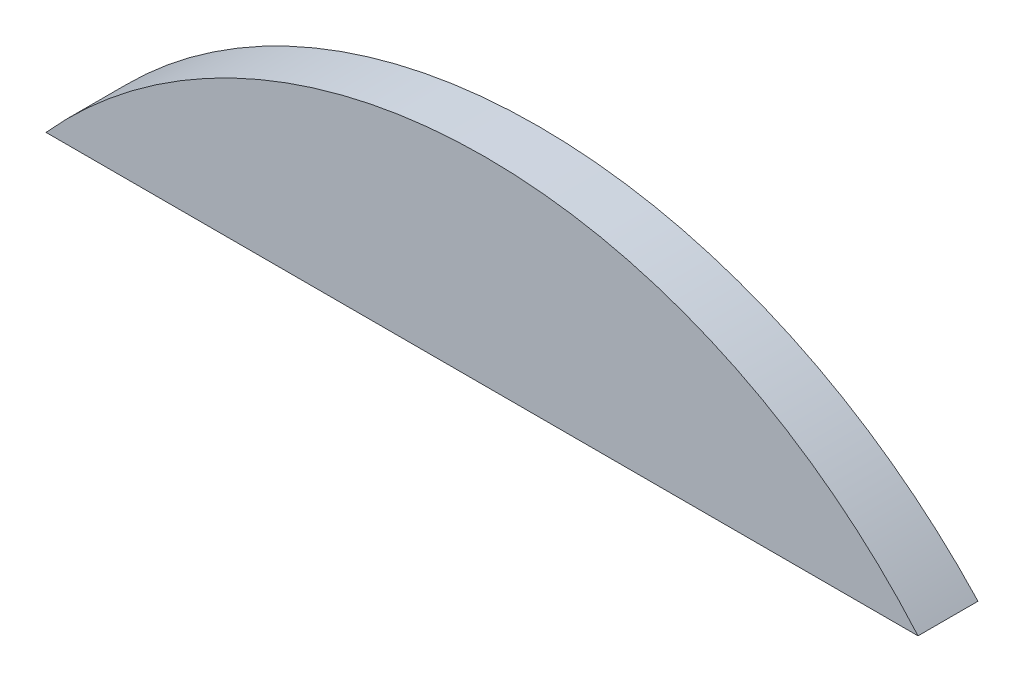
ISO-10303-21;
HEADER;
FILE_DESCRIPTION(('STEP AP214'),'2;1');
FILE_NAME('part.step','',(''),(''),'','','');
FILE_SCHEMA(('AUTOMOTIVE_DESIGN { 1 0 10303 214 1 1 1 1 }'));
ENDSEC;
DATA;
#1=APPLICATION_CONTEXT('core data for automotive mechanical design processes');
#2=APPLICATION_PROTOCOL_DEFINITION('international standard','automotive_design',2000,#1);
#3=PRODUCT_CONTEXT('',#1,'mechanical');
#4=PRODUCT('Part','Part','',(#3));
#5=PRODUCT_RELATED_PRODUCT_CATEGORY('part','',(#4));
#6=PRODUCT_DEFINITION_FORMATION('','',#4);
#7=PRODUCT_DEFINITION_CONTEXT('part definition',#1,'design');
#8=PRODUCT_DEFINITION('design','',#6,#7);
#9=PRODUCT_DEFINITION_SHAPE('','',#8);
#10=(LENGTH_UNIT() NAMED_UNIT(*) SI_UNIT(.MILLI.,.METRE.));
#11=(NAMED_UNIT(*) PLANE_ANGLE_UNIT() SI_UNIT($,.RADIAN.));
#12=(NAMED_UNIT(*) SI_UNIT($,.STERADIAN.) SOLID_ANGLE_UNIT());
#13=UNCERTAINTY_MEASURE_WITH_UNIT(LENGTH_MEASURE(1.E-05),#10,'distance_accuracy_value','');
#14=(GEOMETRIC_REPRESENTATION_CONTEXT(3) GLOBAL_UNCERTAINTY_ASSIGNED_CONTEXT((#13)) GLOBAL_UNIT_ASSIGNED_CONTEXT((#10,
#11,#12)) REPRESENTATION_CONTEXT('',''));
#15=CARTESIAN_POINT('',(0.,0.,0.));
#16=DIRECTION('',(0.,0.,1.));
#17=DIRECTION('',(1.,0.,0.));
#18=AXIS2_PLACEMENT_3D('',#15,#16,#17);
#19=CARTESIAN_POINT('',(0.,0.,1.5));
#20=DIRECTION('',(0.,0.,-1.));
#21=DIRECTION('',(-1.,0.,0.));
#22=AXIS2_PLACEMENT_3D('',#19,#20,#21);
#23=CYLINDRICAL_SURFACE('',#22,33.);
#24=CARTESIAN_POINT('',(0.,0.,-2.07601714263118));
#25=DIRECTION('',(0.,0.0174524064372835,-0.999847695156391));
#26=DIRECTION('',(0.,-0.999847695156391,-0.0174524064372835));
#27=AXIS2_PLACEMENT_3D('',#24,#25,#26);
#28=ELLIPSE('',#27,33.005026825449,33.);
#29=CARTESIAN_POINT('',(24.5967477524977,22.,-1.69200571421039));
#30=VERTEX_POINT('',#29);
#31=CARTESIAN_POINT('',(-24.5967477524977,22.,-1.69200571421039));
#32=VERTEX_POINT('',#31);
#33=EDGE_CURVE('E57',#30,#32,#28,.F.);
#34=ORIENTED_EDGE('',*,*,#33,.T.);
#35=DIRECTION('',(0.,0.,-1.));
#36=VECTOR('',#35,1.);
#37=CARTESIAN_POINT('',(-24.5967477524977,22.,1.5));
#38=LINE('',#37,#36);
#39=CARTESIAN_POINT('',(-24.5967477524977,22.,1.69200571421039));
#40=VERTEX_POINT('',#39);
#41=EDGE_CURVE('E11',#40,#32,#38,.T.);
#42=ORIENTED_EDGE('',*,*,#41,.F.);
#43=CARTESIAN_POINT('',(0.,0.,2.07601714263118));
#44=DIRECTION('',(0.,0.0174524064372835,0.999847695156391));
#45=DIRECTION('',(0.,0.999847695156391,-0.0174524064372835));
#46=AXIS2_PLACEMENT_3D('',#43,#44,#45);
#47=ELLIPSE('',#46,33.005026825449,33.);
#48=CARTESIAN_POINT('',(24.5967477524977,22.,1.69200571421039));
#49=VERTEX_POINT('',#48);
#50=EDGE_CURVE('E60',#49,#40,#47,.T.);
#51=ORIENTED_EDGE('',*,*,#50,.F.);
#52=DIRECTION('',(0.,0.,-1.));
#53=VECTOR('',#52,1.);
#54=CARTESIAN_POINT('',(24.5967477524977,22.,1.5));
#55=LINE('',#54,#53);
#56=EDGE_CURVE('E39',#49,#30,#55,.T.);
#57=ORIENTED_EDGE('',*,*,#56,.T.);
#58=EDGE_LOOP('',(#34,#42,#51,#57));
#59=FACE_BOUND('',#58,.T.);
#60=ADVANCED_FACE('F29',(#59),#23,.T.);
#61=CARTESIAN_POINT('',(-24.5967477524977,22.,1.5));
#62=DIRECTION('',(0.,1.,0.));
#63=DIRECTION('',(0.,0.,1.));
#64=AXIS2_PLACEMENT_3D('',#61,#62,#63);
#65=PLANE('',#64);
#66=DIRECTION('',(-1.,0.,0.));
#67=VECTOR('',#66,1.);
#68=CARTESIAN_POINT('',(-24.5967477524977,22.,-1.69200571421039));
#69=LINE('',#68,#67);
#70=EDGE_CURVE('E54',#32,#30,#69,.F.);
#71=ORIENTED_EDGE('',*,*,#70,.T.);
#72=ORIENTED_EDGE('',*,*,#56,.F.);
#73=DIRECTION('',(1.,0.,0.));
#74=VECTOR('',#73,1.);
#75=CARTESIAN_POINT('',(-24.5967477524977,22.,1.69200571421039));
#76=LINE('',#75,#74);
#77=EDGE_CURVE('E33',#40,#49,#76,.T.);
#78=ORIENTED_EDGE('',*,*,#77,.F.);
#79=ORIENTED_EDGE('',*,*,#41,.T.);
#80=EDGE_LOOP('',(#71,#72,#78,#79));
#81=FACE_BOUND('',#80,.T.);
#82=ADVANCED_FACE('F63',(#81),#65,.F.);
#83=CARTESIAN_POINT('',(0.,33.,1.5));
#84=DIRECTION('',(0.,0.0174524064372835,0.999847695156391));
#85=DIRECTION('',(0.,-0.999847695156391,0.0174524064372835));
#86=AXIS2_PLACEMENT_3D('',#83,#84,#85);
#87=PLANE('',#86);
#88=ORIENTED_EDGE('',*,*,#50,.T.);
#89=ORIENTED_EDGE('',*,*,#77,.T.);
#90=EDGE_LOOP('',(#88,#89));
#91=FACE_BOUND('',#90,.T.);
#92=ADVANCED_FACE('F31',(#91),#87,.T.);
#93=CARTESIAN_POINT('',(0.,33.,-1.5));
#94=DIRECTION('',(0.,0.0174524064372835,-0.999847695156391));
#95=DIRECTION('',(0.,0.999847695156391,0.0174524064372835));
#96=AXIS2_PLACEMENT_3D('',#93,#94,#95);
#97=PLANE('',#96);
#98=ORIENTED_EDGE('',*,*,#33,.F.);
#99=ORIENTED_EDGE('',*,*,#70,.F.);
#100=EDGE_LOOP('',(#98,#99));
#101=FACE_BOUND('',#100,.T.);
#102=ADVANCED_FACE('F55',(#101),#97,.T.);
#103=CLOSED_SHELL('',(#60,#82,#92,#102));
#104=MANIFOLD_SOLID_BREP('B2',#103);
#105=ADVANCED_BREP_SHAPE_REPRESENTATION('',(#18,#104),#14);
#106=SHAPE_DEFINITION_REPRESENTATION(#9,#105);
ENDSEC;
END-ISO-10303-21;
